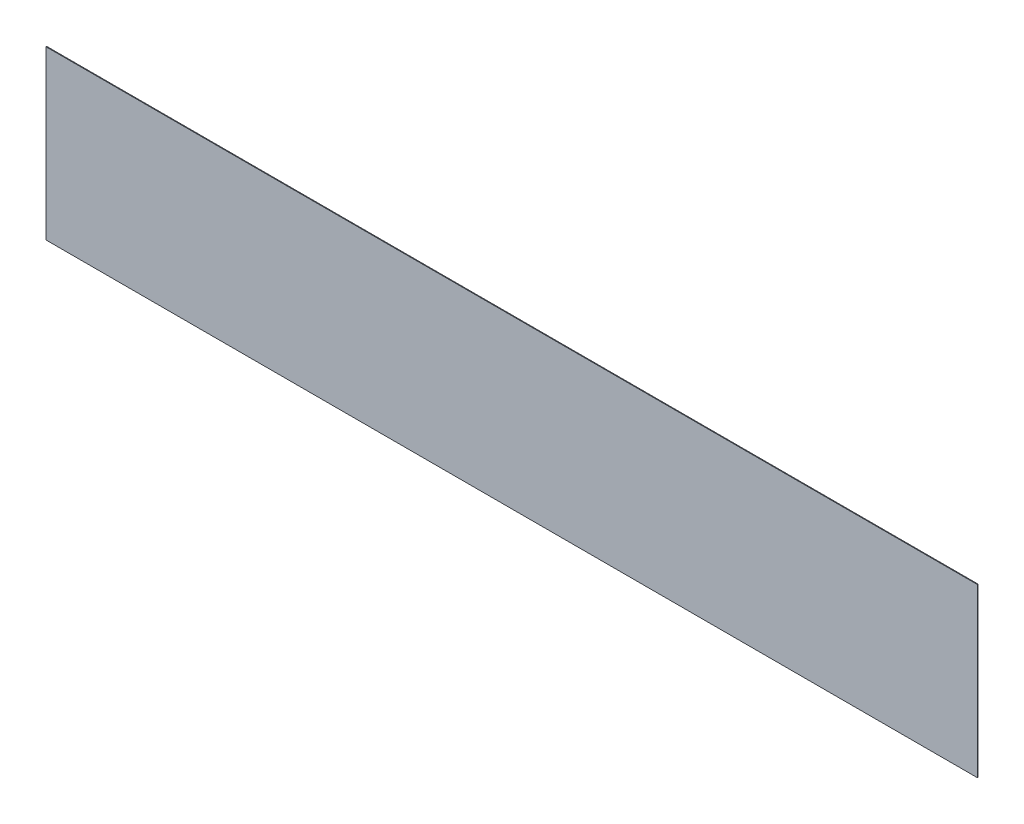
ISO-10303-21;
HEADER;
FILE_DESCRIPTION(('STEP AP214'),'2;1');
FILE_NAME('part.step','',(''),(''),'','','');
FILE_SCHEMA(('AUTOMOTIVE_DESIGN { 1 0 10303 214 1 1 1 1 }'));
ENDSEC;
DATA;
#1=APPLICATION_CONTEXT('core data for automotive mechanical design processes');
#2=APPLICATION_PROTOCOL_DEFINITION('international standard','automotive_design',2000,#1);
#3=PRODUCT_CONTEXT('',#1,'mechanical');
#4=PRODUCT('Part','Part','',(#3));
#5=PRODUCT_RELATED_PRODUCT_CATEGORY('part','',(#4));
#6=PRODUCT_DEFINITION_FORMATION('','',#4);
#7=PRODUCT_DEFINITION_CONTEXT('part definition',#1,'design');
#8=PRODUCT_DEFINITION('design','',#6,#7);
#9=PRODUCT_DEFINITION_SHAPE('','',#8);
#10=(LENGTH_UNIT() NAMED_UNIT(*) SI_UNIT(.MILLI.,.METRE.));
#11=(NAMED_UNIT(*) PLANE_ANGLE_UNIT() SI_UNIT($,.RADIAN.));
#12=(NAMED_UNIT(*) SI_UNIT($,.STERADIAN.) SOLID_ANGLE_UNIT());
#13=UNCERTAINTY_MEASURE_WITH_UNIT(LENGTH_MEASURE(1.E-05),#10,'distance_accuracy_value','');
#14=(GEOMETRIC_REPRESENTATION_CONTEXT(3) GLOBAL_UNCERTAINTY_ASSIGNED_CONTEXT((#13)) GLOBAL_UNIT_ASSIGNED_CONTEXT((#10,
#11,#12)) REPRESENTATION_CONTEXT('',''));
#15=CARTESIAN_POINT('',(0.,0.,0.));
#16=DIRECTION('',(0.,0.,1.));
#17=DIRECTION('',(1.,0.,0.));
#18=AXIS2_PLACEMENT_3D('',#15,#16,#17);
#19=CARTESIAN_POINT('',(0.,0.,0.762));
#20=DIRECTION('',(1.,0.,0.));
#21=DIRECTION('',(0.,0.,-1.));
#22=AXIS2_PLACEMENT_3D('',#19,#20,#21);
#23=PLANE('',#22);
#24=DIRECTION('',(0.,-1.,0.));
#25=VECTOR('',#24,1.);
#26=CARTESIAN_POINT('',(0.,0.,0.));
#27=LINE('',#26,#25);
#28=CARTESIAN_POINT('',(0.,177.8,0.));
#29=VERTEX_POINT('',#28);
#30=CARTESIAN_POINT('',(0.,0.,0.));
#31=VERTEX_POINT('',#30);
#32=EDGE_CURVE('E114',#29,#31,#27,.T.);
#33=ORIENTED_EDGE('',*,*,#32,.T.);
#34=DIRECTION('',(0.,0.,-1.));
#35=VECTOR('',#34,1.);
#36=CARTESIAN_POINT('',(0.,0.,0.762));
#37=LINE('',#36,#35);
#38=CARTESIAN_POINT('',(0.,0.,0.762));
#39=VERTEX_POINT('',#38);
#40=EDGE_CURVE('E11',#39,#31,#37,.T.);
#41=ORIENTED_EDGE('',*,*,#40,.F.);
#42=DIRECTION('',(0.,-1.,0.));
#43=VECTOR('',#42,1.);
#44=CARTESIAN_POINT('',(0.,0.,0.762));
#45=LINE('',#44,#43);
#46=CARTESIAN_POINT('',(0.,177.8,0.762));
#47=VERTEX_POINT('',#46);
#48=EDGE_CURVE('E97',#47,#39,#45,.T.);
#49=ORIENTED_EDGE('',*,*,#48,.F.);
#50=DIRECTION('',(0.,0.,-1.));
#51=VECTOR('',#50,1.);
#52=CARTESIAN_POINT('',(0.,177.8,0.762));
#53=LINE('',#52,#51);
#54=EDGE_CURVE('E110',#47,#29,#53,.T.);
#55=ORIENTED_EDGE('',*,*,#54,.T.);
#56=EDGE_LOOP('',(#33,#41,#49,#55));
#57=FACE_BOUND('',#56,.T.);
#58=ADVANCED_FACE('F45',(#57),#23,.F.);
#59=CARTESIAN_POINT('',(0.,0.,0.762));
#60=DIRECTION('',(0.,1.,0.));
#61=DIRECTION('',(0.,0.,1.));
#62=AXIS2_PLACEMENT_3D('',#59,#60,#61);
#63=PLANE('',#62);
#64=DIRECTION('',(1.,0.,0.));
#65=VECTOR('',#64,1.);
#66=CARTESIAN_POINT('',(0.,0.,0.));
#67=LINE('',#66,#65);
#68=CARTESIAN_POINT('',(989.476022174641,0.,0.));
#69=VERTEX_POINT('',#68);
#70=EDGE_CURVE('E102',#31,#69,#67,.T.);
#71=ORIENTED_EDGE('',*,*,#70,.T.);
#72=DIRECTION('',(0.,0.,-1.));
#73=VECTOR('',#72,1.);
#74=CARTESIAN_POINT('',(989.476022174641,0.,0.762));
#75=LINE('',#74,#73);
#76=CARTESIAN_POINT('',(989.476022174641,0.,0.762));
#77=VERTEX_POINT('',#76);
#78=EDGE_CURVE('E54',#77,#69,#75,.T.);
#79=ORIENTED_EDGE('',*,*,#78,.F.);
#80=DIRECTION('',(1.,0.,0.));
#81=VECTOR('',#80,1.);
#82=CARTESIAN_POINT('',(0.,0.,0.762));
#83=LINE('',#82,#81);
#84=EDGE_CURVE('E92',#39,#77,#83,.T.);
#85=ORIENTED_EDGE('',*,*,#84,.F.);
#86=ORIENTED_EDGE('',*,*,#40,.T.);
#87=EDGE_LOOP('',(#71,#79,#85,#86));
#88=FACE_BOUND('',#87,.T.);
#89=ADVANCED_FACE('F101',(#88),#63,.F.);
#90=CARTESIAN_POINT('',(989.476022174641,0.,0.762));
#91=DIRECTION('',(-1.,0.,0.));
#92=DIRECTION('',(0.,0.,1.));
#93=AXIS2_PLACEMENT_3D('',#90,#91,#92);
#94=PLANE('',#93);
#95=DIRECTION('',(0.,1.,0.));
#96=VECTOR('',#95,1.);
#97=CARTESIAN_POINT('',(989.476022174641,0.,0.));
#98=LINE('',#97,#96);
#99=CARTESIAN_POINT('',(989.476022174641,177.8,0.));
#100=VERTEX_POINT('',#99);
#101=EDGE_CURVE('E79',#69,#100,#98,.T.);
#102=ORIENTED_EDGE('',*,*,#101,.T.);
#103=DIRECTION('',(0.,0.,-1.));
#104=VECTOR('',#103,1.);
#105=CARTESIAN_POINT('',(989.476022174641,177.8,0.762));
#106=LINE('',#105,#104);
#107=CARTESIAN_POINT('',(989.476022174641,177.8,0.762));
#108=VERTEX_POINT('',#107);
#109=EDGE_CURVE('E104',#108,#100,#106,.T.);
#110=ORIENTED_EDGE('',*,*,#109,.F.);
#111=DIRECTION('',(0.,1.,0.));
#112=VECTOR('',#111,1.);
#113=CARTESIAN_POINT('',(989.476022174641,0.,0.762));
#114=LINE('',#113,#112);
#115=EDGE_CURVE('E95',#77,#108,#114,.T.);
#116=ORIENTED_EDGE('',*,*,#115,.F.);
#117=ORIENTED_EDGE('',*,*,#78,.T.);
#118=EDGE_LOOP('',(#102,#110,#116,#117));
#119=FACE_BOUND('',#118,.T.);
#120=ADVANCED_FACE('F105',(#119),#94,.F.);
#121=CARTESIAN_POINT('',(0.,177.8,0.762));
#122=DIRECTION('',(0.,-1.,0.));
#123=DIRECTION('',(0.,0.,-1.));
#124=AXIS2_PLACEMENT_3D('',#121,#122,#123);
#125=PLANE('',#124);
#126=DIRECTION('',(-1.,0.,0.));
#127=VECTOR('',#126,1.);
#128=CARTESIAN_POINT('',(0.,177.8,0.));
#129=LINE('',#128,#127);
#130=EDGE_CURVE('E85',#100,#29,#129,.T.);
#131=ORIENTED_EDGE('',*,*,#130,.T.);
#132=ORIENTED_EDGE('',*,*,#54,.F.);
#133=DIRECTION('',(-1.,0.,0.));
#134=VECTOR('',#133,1.);
#135=CARTESIAN_POINT('',(0.,177.8,0.762));
#136=LINE('',#135,#134);
#137=EDGE_CURVE('E62',#108,#47,#136,.T.);
#138=ORIENTED_EDGE('',*,*,#137,.F.);
#139=ORIENTED_EDGE('',*,*,#109,.T.);
#140=EDGE_LOOP('',(#131,#132,#138,#139));
#141=FACE_BOUND('',#140,.T.);
#142=ADVANCED_FACE('F128',(#141),#125,.F.);
#143=CARTESIAN_POINT('',(0.,0.,0.762));
#144=DIRECTION('',(0.,0.,-1.));
#145=DIRECTION('',(-1.,0.,0.));
#146=AXIS2_PLACEMENT_3D('',#143,#144,#145);
#147=PLANE('',#146);
#148=ORIENTED_EDGE('',*,*,#48,.T.);
#149=ORIENTED_EDGE('',*,*,#84,.T.);
#150=ORIENTED_EDGE('',*,*,#115,.T.);
#151=ORIENTED_EDGE('',*,*,#137,.T.);
#152=EDGE_LOOP('',(#148,#149,#150,#151));
#153=FACE_BOUND('',#152,.T.);
#154=ADVANCED_FACE('F93',(#153),#147,.F.);
#155=CARTESIAN_POINT('',(0.,0.,0.));
#156=DIRECTION('',(0.,0.,-1.));
#157=DIRECTION('',(-1.,0.,0.));
#158=AXIS2_PLACEMENT_3D('',#155,#156,#157);
#159=PLANE('',#158);
#160=ORIENTED_EDGE('',*,*,#32,.F.);
#161=ORIENTED_EDGE('',*,*,#130,.F.);
#162=ORIENTED_EDGE('',*,*,#101,.F.);
#163=ORIENTED_EDGE('',*,*,#70,.F.);
#164=EDGE_LOOP('',(#160,#161,#162,#163));
#165=FACE_BOUND('',#164,.T.);
#166=ADVANCED_FACE('F131',(#165),#159,.T.);
#167=CLOSED_SHELL('',(#58,#89,#120,#142,#154,#166));
#168=MANIFOLD_SOLID_BREP('B2',#167);
#169=ADVANCED_BREP_SHAPE_REPRESENTATION('',(#18,#168),#14);
#170=SHAPE_DEFINITION_REPRESENTATION(#9,#169);
ENDSEC;
END-ISO-10303-21;
